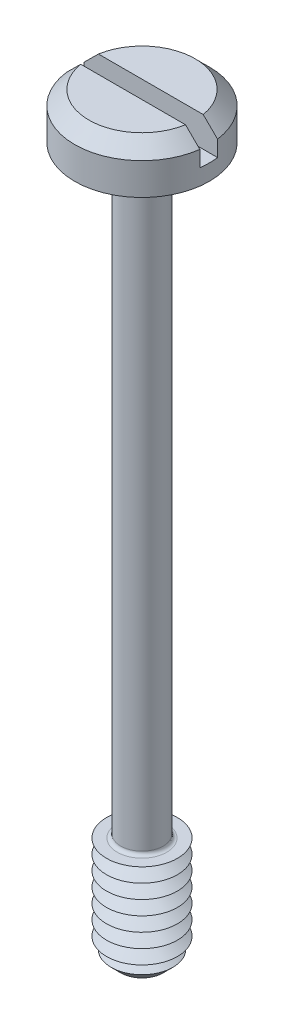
ISO-10303-21;
HEADER;
FILE_DESCRIPTION(('STEP AP214'),'2;1');
FILE_NAME('part.step','',(''),(''),'','','');
FILE_SCHEMA(('AUTOMOTIVE_DESIGN { 1 0 10303 214 1 1 1 1 }'));
ENDSEC;
DATA;
#1=APPLICATION_CONTEXT('core data for automotive mechanical design processes');
#2=APPLICATION_PROTOCOL_DEFINITION('international standard','automotive_design',2000,#1);
#3=PRODUCT_CONTEXT('',#1,'mechanical');
#4=PRODUCT('Part','Part','',(#3));
#5=PRODUCT_RELATED_PRODUCT_CATEGORY('part','',(#4));
#6=PRODUCT_DEFINITION_FORMATION('','',#4);
#7=PRODUCT_DEFINITION_CONTEXT('part definition',#1,'design');
#8=PRODUCT_DEFINITION('design','',#6,#7);
#9=PRODUCT_DEFINITION_SHAPE('','',#8);
#10=(LENGTH_UNIT() NAMED_UNIT(*) SI_UNIT(.MILLI.,.METRE.));
#11=(NAMED_UNIT(*) PLANE_ANGLE_UNIT() SI_UNIT($,.RADIAN.));
#12=(NAMED_UNIT(*) SI_UNIT($,.STERADIAN.) SOLID_ANGLE_UNIT());
#13=UNCERTAINTY_MEASURE_WITH_UNIT(LENGTH_MEASURE(1.E-05),#10,'distance_accuracy_value','');
#14=(GEOMETRIC_REPRESENTATION_CONTEXT(3) GLOBAL_UNCERTAINTY_ASSIGNED_CONTEXT((#13)) GLOBAL_UNIT_ASSIGNED_CONTEXT((#10,
#11,#12)) REPRESENTATION_CONTEXT('',''));
#15=CARTESIAN_POINT('',(0.,0.,0.));
#16=DIRECTION('',(0.,0.,1.));
#17=DIRECTION('',(1.,0.,0.));
#18=AXIS2_PLACEMENT_3D('',#15,#16,#17);
#19=CARTESIAN_POINT('',(0.,1.3,0.));
#20=DIRECTION('',(0.,1.,0.));
#21=DIRECTION('',(0.,0.,1.));
#22=AXIS2_PLACEMENT_3D('',#19,#20,#21);
#23=PLANE('',#22);
#24=DIRECTION('',(-1.,0.,0.));
#25=VECTOR('',#24,1.);
#26=CARTESIAN_POINT('',(1.9,1.3,-0.25));
#27=LINE('',#26,#25);
#28=CARTESIAN_POINT('',(1.4790199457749,1.3,-0.25));
#29=VERTEX_POINT('',#28);
#30=CARTESIAN_POINT('',(-1.4790199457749,1.3,-0.25));
#31=VERTEX_POINT('',#30);
#32=EDGE_CURVE('E110',#29,#31,#27,.T.);
#33=ORIENTED_EDGE('',*,*,#32,.F.);
#34=CARTESIAN_POINT('',(0.,1.3,0.));
#35=DIRECTION('',(0.,1.,0.));
#36=DIRECTION('',(0.,0.,1.));
#37=AXIS2_PLACEMENT_3D('',#34,#35,#36);
#38=CIRCLE('',#37,1.5);
#39=EDGE_CURVE('E113',#29,#31,#38,.T.);
#40=ORIENTED_EDGE('',*,*,#39,.T.);
#41=EDGE_LOOP('',(#33,#40));
#42=FACE_BOUND('',#41,.T.);
#43=ADVANCED_FACE('F39',(#42),#23,.T.);
#44=CARTESIAN_POINT('',(0.,1.3,0.));
#45=DIRECTION('',(0.,-1.,0.));
#46=DIRECTION('',(0.,0.,-1.));
#47=AXIS2_PLACEMENT_3D('',#44,#45,#46);
#48=CONICAL_SURFACE('',#47,1.5,0.785398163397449);
#49=CARTESIAN_POINT('',(4.18533688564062,-1.39279678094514,-0.25));
#50=CARTESIAN_POINT('',(4.0422903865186,-1.25000682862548,-0.25));
#51=CARTESIAN_POINT('',(3.89923277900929,-1.10722799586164,-0.25));
#52=CARTESIAN_POINT('',(3.61307916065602,-0.821704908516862,-0.25));
#53=CARTESIAN_POINT('',(3.46998314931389,-0.678960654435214,-0.25));
#54=CARTESIAN_POINT('',(3.18369629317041,-0.393478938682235,-0.25));
#55=CARTESIAN_POINT('',(3.04050543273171,-0.250741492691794,-0.25));
#56=CARTESIAN_POINT('',(2.75404923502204,0.0346548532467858,-0.25));
#57=CARTESIAN_POINT('',(2.61078389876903,0.177313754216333,-0.25));
#58=CARTESIAN_POINT('',(2.3205519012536,0.466067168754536,-0.25));
#59=CARTESIAN_POINT('',(2.17358212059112,0.612158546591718,-0.25));
#60=CARTESIAN_POINT('',(1.87941274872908,0.904121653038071,-0.25));
#61=CARTESIAN_POINT('',(1.73221314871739,1.04999337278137,-0.25));
#62=CARTESIAN_POINT('',(1.51107316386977,1.26842721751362,-0.25));
#63=CARTESIAN_POINT('',(1.43731034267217,1.34116907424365,-0.25));
#64=CARTESIAN_POINT('',(1.28959621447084,1.48646381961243,-0.25));
#65=CARTESIAN_POINT('',(1.21564490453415,1.55901670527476,-0.25));
#66=CARTESIAN_POINT('',(1.06743357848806,1.70379537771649,-0.25));
#67=CARTESIAN_POINT('',(0.993173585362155,1.77602118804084,-0.25));
#68=CARTESIAN_POINT('',(0.844093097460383,1.91989140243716,-0.25));
#69=CARTESIAN_POINT('',(0.76927262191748,1.99153582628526,-0.25));
#70=CARTESIAN_POINT('',(0.673453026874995,2.0816726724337,-0.25));
#71=CARTESIAN_POINT('',(0.653038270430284,2.10078477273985,-0.25));
#72=CARTESIAN_POINT('',(0.612082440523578,2.13887320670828,-0.25));
#73=CARTESIAN_POINT('',(0.591541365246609,2.1578495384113,-0.25));
#74=CARTESIAN_POINT('',(0.529771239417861,2.21444296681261,-0.25));
#75=CARTESIAN_POINT('',(0.488307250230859,2.25180787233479,-0.25));
#76=CARTESIAN_POINT('',(0.41966366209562,2.31168392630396,-0.25));
#77=CARTESIAN_POINT('',(0.39284043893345,2.3346028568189,-0.25));
#78=CARTESIAN_POINT('',(0.338329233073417,2.37961554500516,-0.25));
#79=CARTESIAN_POINT('',(0.310638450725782,2.40170598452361,-0.25));
#80=CARTESIAN_POINT('',(0.267983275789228,2.43362951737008,-0.25));
#81=CARTESIAN_POINT('',(0.2535095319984,2.4441138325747,-0.25));
#82=CARTESIAN_POINT('',(0.224109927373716,2.46442369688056,-0.25));
#83=CARTESIAN_POINT('',(0.209184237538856,2.47424949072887,-0.25));
#84=CARTESIAN_POINT('',(0.178776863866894,2.49288890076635,-0.25));
#85=CARTESIAN_POINT('',(0.16329738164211,2.50170604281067,-0.25));
#86=CARTESIAN_POINT('',(0.131578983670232,2.51781823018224,-0.25));
#87=CARTESIAN_POINT('',(0.115341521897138,2.52511605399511,-0.25));
#88=CARTESIAN_POINT('',(0.0816993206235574,2.53745946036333,-0.25));
#89=CARTESIAN_POINT('',(0.0642805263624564,2.54246888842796,-0.25));
#90=CARTESIAN_POINT('',(0.028863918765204,2.54892929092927,-0.25));
#91=CARTESIAN_POINT('',(0.0108708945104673,2.55040442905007,-0.25));
#92=CARTESIAN_POINT('',(-0.0250443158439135,2.54939473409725,-0.25));
#93=CARTESIAN_POINT('',(-0.0429661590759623,2.54689872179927,-0.25));
#94=CARTESIAN_POINT('',(-0.0781147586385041,2.5386496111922,-0.25));
#95=CARTESIAN_POINT('',(-0.0953356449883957,2.53287340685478,-0.25));
#96=CARTESIAN_POINT('',(-0.13219925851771,2.51779776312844,-0.25));
#97=CARTESIAN_POINT('',(-0.151639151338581,2.50802516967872,-0.25));
#98=CARTESIAN_POINT('',(-0.189519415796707,2.48667393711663,-0.25));
#99=CARTESIAN_POINT('',(-0.207957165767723,2.47509084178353,-0.25));
#100=CARTESIAN_POINT('',(-0.244227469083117,2.45076455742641,-0.25));
#101=CARTESIAN_POINT('',(-0.262054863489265,2.43801379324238,-0.25));
#102=CARTESIAN_POINT('',(-0.297164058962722,2.41183569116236,-0.25));
#103=CARTESIAN_POINT('',(-0.314446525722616,2.39840923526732,-0.25));
#104=CARTESIAN_POINT('',(-0.371053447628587,2.35323015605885,-0.25));
#105=CARTESIAN_POINT('',(-0.409598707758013,2.32050831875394,-0.25));
#106=CARTESIAN_POINT('',(-0.485753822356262,2.25398879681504,-0.25));
#107=CARTESIAN_POINT('',(-0.52336327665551,2.2201906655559,-0.25));
#108=CARTESIAN_POINT('',(-0.598084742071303,2.15194710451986,-0.25));
#109=CARTESIAN_POINT('',(-0.635196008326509,2.11750085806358,-0.25));
#110=CARTESIAN_POINT('',(-0.709072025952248,2.04825489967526,-0.25));
#111=CARTESIAN_POINT('',(-0.74583684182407,2.01345525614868,-0.25));
#112=CARTESIAN_POINT('',(-0.855349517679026,1.90914588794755,-0.25));
#113=CARTESIAN_POINT('',(-0.927775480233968,1.83929849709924,-0.25));
#114=CARTESIAN_POINT('',(-1.07215273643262,1.69921833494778,-0.25));
#115=CARTESIAN_POINT('',(-1.14410432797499,1.62898586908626,-0.25));
#116=CARTESIAN_POINT('',(-1.33992197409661,1.43719038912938,-0.25));
#117=CARTESIAN_POINT('',(-1.46354933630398,1.31538371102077,-0.25));
#118=CARTESIAN_POINT('',(-1.71048263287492,1.07144356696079,-0.25));
#119=CARTESIAN_POINT('',(-1.83378856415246,0.949310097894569,-0.25));
#120=CARTESIAN_POINT('',(-2.20352581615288,0.582566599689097,-0.25));
#121=CARTESIAN_POINT('',(-2.44969583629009,0.337693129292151,-0.25));
#122=CARTESIAN_POINT('',(-2.94423335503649,-0.154747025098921,-0.25));
#123=CARTESIAN_POINT('',(-3.19259832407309,-0.402316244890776,-0.25));
#124=CARTESIAN_POINT('',(-3.68909403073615,-0.897516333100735,-0.25));
#125=CARTESIAN_POINT('',(-3.93722481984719,-1.14514714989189,-0.25));
#126=CARTESIAN_POINT('',(-4.18533688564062,-1.39279678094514,-0.25));
#127=B_SPLINE_CURVE_WITH_KNOTS('',3,(#49,#50,#51,#52,#53,#54,#55,#56,#57,#58,#59,#60,#61,#62,
#63,#64,#65,#66,#67,#68,#69,#70,#71,#72,#73,#74,#75,#76,#77,#78,#79,#80,#81,#82,#83,#84,#85,#86,
#87,#88,#89,#90,#91,#92,#93,#94,#95,#96,#97,#98,#99,#100,#101,#102,#103,#104,#105,#106,#107,
#108,#109,#110,#111,#112,#113,#114,#115,#116,#117,#118,#119,#120,#121,#122,#123,#124,#125,#126),
.UNSPECIFIED.,.F.,.F.,(4,2,2,2,2,2,2,2,2,2,2,2,2,2,2,2,2,2,2,2,2,2,2,2,2,2,2,2,2,2,2,2,2,2,2,2,
2,2,4),(0.,0.606350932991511,1.21271015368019,1.81925643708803,2.42579463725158,
3.04747398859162,3.66917779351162,3.97996857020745,4.29076421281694,4.60153711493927,
4.91229940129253,4.99619332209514,5.08008845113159,5.24751495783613,5.35335108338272,
5.45957361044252,5.5131778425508,5.56676204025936,5.62015280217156,5.67344504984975,
5.72755238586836,5.78128872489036,5.83517660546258,5.88944887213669,5.95455572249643,
6.01982542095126,6.08555345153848,6.15119780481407,6.30282427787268,6.45451451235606,
6.60641073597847,6.75827809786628,7.06012987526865,7.3617694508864,7.88242595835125,
8.40308744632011,9.44475070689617,10.4967873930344,11.5484571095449),.UNSPECIFIED.);
#128=CARTESIAN_POINT('',(1.88348082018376,0.899999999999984,-0.25));
#129=VERTEX_POINT('',#128);
#130=EDGE_CURVE('E252',#129,#29,#127,.T.);
#131=ORIENTED_EDGE('',*,*,#130,.F.);
#132=CARTESIAN_POINT('',(0.,0.899999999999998,0.));
#133=DIRECTION('',(0.,1.,0.));
#134=DIRECTION('',(0.,0.,1.));
#135=AXIS2_PLACEMENT_3D('',#132,#133,#134);
#136=CIRCLE('',#135,1.9);
#137=CARTESIAN_POINT('',(-1.88348082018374,0.899999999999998,-0.25));
#138=VERTEX_POINT('',#137);
#139=EDGE_CURVE('E128',#138,#129,#136,.F.);
#140=ORIENTED_EDGE('',*,*,#139,.F.);
#141=EDGE_CURVE('E102',#31,#138,#127,.T.);
#142=ORIENTED_EDGE('',*,*,#141,.F.);
#143=ORIENTED_EDGE('',*,*,#39,.F.);
#144=EDGE_LOOP('',(#131,#140,#142,#143));
#145=FACE_BOUND('',#144,.T.);
#146=ADVANCED_FACE('F214',(#145),#48,.T.);
#147=CARTESIAN_POINT('',(0.,-20.,0.));
#148=DIRECTION('',(0.,1.,0.));
#149=DIRECTION('',(0.,0.,1.));
#150=AXIS2_PLACEMENT_3D('',#147,#148,#149);
#151=CYLINDRICAL_SURFACE('',#150,0.6);
#152=CARTESIAN_POINT('',(0.,-16.9,0.));
#153=DIRECTION('',(0.,-1.,0.));
#154=DIRECTION('',(0.,0.,-1.));
#155=AXIS2_PLACEMENT_3D('',#152,#153,#154);
#156=CIRCLE('',#155,0.6);
#157=CARTESIAN_POINT('',(0.,-16.9,-0.6));
#158=VERTEX_POINT('',#157);
#159=EDGE_CURVE('E123',#158,#158,#156,.F.);
#160=ORIENTED_EDGE('',*,*,#159,.T.);
#161=EDGE_LOOP('',(#160));
#162=FACE_BOUND('',#161,.T.);
#163=CARTESIAN_POINT('',(0.,-0.0999999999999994,0.));
#164=DIRECTION('',(0.,1.,0.));
#165=DIRECTION('',(0.,0.,1.));
#166=AXIS2_PLACEMENT_3D('',#163,#164,#165);
#167=CIRCLE('',#166,0.6);
#168=CARTESIAN_POINT('',(0.,-0.0999999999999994,0.6));
#169=VERTEX_POINT('',#168);
#170=EDGE_CURVE('E350',#169,#169,#167,.F.);
#171=ORIENTED_EDGE('',*,*,#170,.T.);
#172=EDGE_LOOP('',(#171));
#173=FACE_BOUND('',#172,.T.);
#174=ADVANCED_FACE('F210',(#162,#173),#151,.T.);
#175=CARTESIAN_POINT('',(0.,1.3,0.));
#176=DIRECTION('',(0.,-1.,0.));
#177=DIRECTION('',(0.,0.,-1.));
#178=AXIS2_PLACEMENT_3D('',#175,#176,#177);
#179=CYLINDRICAL_SURFACE('',#178,1.9);
#180=ORIENTED_EDGE('',*,*,#139,.T.);
#181=DIRECTION('',(0.,-1.,0.));
#182=VECTOR('',#181,1.);
#183=CARTESIAN_POINT('',(1.88348082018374,1.3,-0.25));
#184=LINE('',#183,#182);
#185=CARTESIAN_POINT('',(1.88348082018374,0.45,-0.25));
#186=VERTEX_POINT('',#185);
#187=EDGE_CURVE('E64',#129,#186,#184,.T.);
#188=ORIENTED_EDGE('',*,*,#187,.T.);
#189=CARTESIAN_POINT('',(0.,0.45,0.));
#190=DIRECTION('',(0.,1.,0.));
#191=DIRECTION('',(0.,0.,1.));
#192=AXIS2_PLACEMENT_3D('',#189,#190,#191);
#193=CIRCLE('',#192,1.9);
#194=CARTESIAN_POINT('',(1.88348082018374,0.45,0.25));
#195=VERTEX_POINT('',#194);
#196=EDGE_CURVE('E11',#195,#186,#193,.T.);
#197=ORIENTED_EDGE('',*,*,#196,.F.);
#198=DIRECTION('',(0.,-1.,0.));
#199=VECTOR('',#198,1.);
#200=CARTESIAN_POINT('',(1.88348082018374,1.3,0.25));
#201=LINE('',#200,#199);
#202=CARTESIAN_POINT('',(1.88348082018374,0.899999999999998,0.25));
#203=VERTEX_POINT('',#202);
#204=EDGE_CURVE('E268',#195,#203,#201,.F.);
#205=ORIENTED_EDGE('',*,*,#204,.T.);
#206=CARTESIAN_POINT('',(-1.88348082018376,0.899999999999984,0.25));
#207=VERTEX_POINT('',#206);
#208=EDGE_CURVE('E120',#203,#207,#136,.F.);
#209=ORIENTED_EDGE('',*,*,#208,.T.);
#210=DIRECTION('',(0.,-1.,0.));
#211=VECTOR('',#210,1.);
#212=CARTESIAN_POINT('',(-1.88348082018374,1.3,0.25));
#213=LINE('',#212,#211);
#214=CARTESIAN_POINT('',(-1.88348082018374,0.45,0.25));
#215=VERTEX_POINT('',#214);
#216=EDGE_CURVE('E96',#207,#215,#213,.T.);
#217=ORIENTED_EDGE('',*,*,#216,.T.);
#218=CARTESIAN_POINT('',(-1.88348082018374,0.45,-0.25));
#219=VERTEX_POINT('',#218);
#220=EDGE_CURVE('E44',#219,#215,#193,.T.);
#221=ORIENTED_EDGE('',*,*,#220,.F.);
#222=DIRECTION('',(0.,-1.,0.));
#223=VECTOR('',#222,1.);
#224=CARTESIAN_POINT('',(-1.88348082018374,1.3,-0.25));
#225=LINE('',#224,#223);
#226=EDGE_CURVE('E272',#219,#138,#225,.F.);
#227=ORIENTED_EDGE('',*,*,#226,.T.);
#228=EDGE_LOOP('',(#180,#188,#197,#205,#209,#217,#221,#227));
#229=FACE_BOUND('',#228,.T.);
#230=CARTESIAN_POINT('',(0.,0.,0.));
#231=DIRECTION('',(0.,1.,0.));
#232=DIRECTION('',(0.,0.,1.));
#233=AXIS2_PLACEMENT_3D('',#230,#231,#232);
#234=CIRCLE('',#233,1.9);
#235=CARTESIAN_POINT('',(0.,0.,1.9));
#236=VERTEX_POINT('',#235);
#237=EDGE_CURVE('E335',#236,#236,#234,.T.);
#238=ORIENTED_EDGE('',*,*,#237,.T.);
#239=EDGE_LOOP('',(#238));
#240=FACE_BOUND('',#239,.T.);
#241=ADVANCED_FACE('F213',(#229,#240),#179,.T.);
#242=DIRECTION('',(1.,0.,0.));
#243=VECTOR('',#242,1.);
#244=CARTESIAN_POINT('',(1.9,1.3,0.25));
#245=LINE('',#244,#243);
#246=CARTESIAN_POINT('',(-1.4790199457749,1.3,0.25));
#247=VERTEX_POINT('',#246);
#248=CARTESIAN_POINT('',(1.4790199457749,1.3,0.25));
#249=VERTEX_POINT('',#248);
#250=EDGE_CURVE('E56',#247,#249,#245,.T.);
#251=ORIENTED_EDGE('',*,*,#250,.F.);
#252=EDGE_CURVE('E108',#247,#249,#38,.T.);
#253=ORIENTED_EDGE('',*,*,#252,.T.);
#254=EDGE_LOOP('',(#251,#253));
#255=FACE_BOUND('',#254,.T.);
#256=ADVANCED_FACE('F107',(#255),#23,.T.);
#257=CARTESIAN_POINT('',(0.,0.,0.));
#258=DIRECTION('',(0.,1.,0.));
#259=DIRECTION('',(0.,0.,1.));
#260=AXIS2_PLACEMENT_3D('',#257,#258,#259);
#261=PLANE('',#260);
#262=CARTESIAN_POINT('',(0.,0.,0.));
#263=DIRECTION('',(0.,1.,0.));
#264=DIRECTION('',(0.,0.,1.));
#265=AXIS2_PLACEMENT_3D('',#262,#263,#264);
#266=CIRCLE('',#265,0.7);
#267=CARTESIAN_POINT('',(0.,0.,0.7));
#268=VERTEX_POINT('',#267);
#269=EDGE_CURVE('E114',#268,#268,#266,.T.);
#270=ORIENTED_EDGE('',*,*,#269,.T.);
#271=EDGE_LOOP('',(#270));
#272=FACE_BOUND('',#271,.T.);
#273=ORIENTED_EDGE('',*,*,#237,.F.);
#274=EDGE_LOOP('',(#273));
#275=FACE_BOUND('',#274,.T.);
#276=ADVANCED_FACE('F204',(#272,#275),#261,.F.);
#277=CARTESIAN_POINT('',(0.,-17.,0.));
#278=DIRECTION('',(0.,-1.,0.));
#279=DIRECTION('',(0.,0.,-1.));
#280=AXIS2_PLACEMENT_3D('',#277,#278,#279);
#281=PLANE('',#280);
#282=CARTESIAN_POINT('',(0.,-17.,0.));
#283=DIRECTION('',(0.,-1.,0.));
#284=DIRECTION('',(0.,0.,-1.));
#285=AXIS2_PLACEMENT_3D('',#282,#283,#284);
#286=CIRCLE('',#285,0.7);
#287=CARTESIAN_POINT('',(0.,-17.,-0.7));
#288=VERTEX_POINT('',#287);
#289=EDGE_CURVE('E343',#288,#288,#286,.T.);
#290=ORIENTED_EDGE('',*,*,#289,.T.);
#291=EDGE_LOOP('',(#290));
#292=FACE_BOUND('',#291,.T.);
#293=CARTESIAN_POINT('',(0.,-17.,0.));
#294=DIRECTION('',(0.,1.,0.));
#295=DIRECTION('',(0.,0.,1.));
#296=AXIS2_PLACEMENT_3D('',#293,#294,#295);
#297=CIRCLE('',#296,1.);
#298=CARTESIAN_POINT('',(0.,-17.,1.));
#299=VERTEX_POINT('',#298);
#300=EDGE_CURVE('E331',#299,#299,#297,.T.);
#301=ORIENTED_EDGE('',*,*,#300,.T.);
#302=EDGE_LOOP('',(#301));
#303=FACE_BOUND('',#302,.T.);
#304=ADVANCED_FACE('F200',(#292,#303),#281,.F.);
#305=CARTESIAN_POINT('',(0.,-17.2,0.));
#306=DIRECTION('',(0.,1.,0.));
#307=DIRECTION('',(0.,0.,1.));
#308=AXIS2_PLACEMENT_3D('',#305,#306,#307);
#309=CONICAL_SURFACE('',#308,0.653589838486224,1.0471975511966);
#310=ORIENTED_EDGE('',*,*,#300,.F.);
#311=EDGE_LOOP('',(#310));
#312=FACE_BOUND('',#311,.T.);
#313=CARTESIAN_POINT('',(0.,-17.2,0.));
#314=DIRECTION('',(0.,1.,0.));
#315=DIRECTION('',(0.,0.,1.));
#316=AXIS2_PLACEMENT_3D('',#313,#314,#315);
#317=CIRCLE('',#316,0.653589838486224);
#318=CARTESIAN_POINT('',(0.,-17.2,0.653589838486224));
#319=VERTEX_POINT('',#318);
#320=EDGE_CURVE('E328',#319,#319,#317,.T.);
#321=ORIENTED_EDGE('',*,*,#320,.T.);
#322=EDGE_LOOP('',(#321));
#323=FACE_BOUND('',#322,.T.);
#324=ADVANCED_FACE('F196',(#312,#323),#309,.T.);
#325=CARTESIAN_POINT('',(0.,-17.4,0.));
#326=DIRECTION('',(0.,-1.,0.));
#327=DIRECTION('',(0.,0.,-1.));
#328=AXIS2_PLACEMENT_3D('',#325,#326,#327);
#329=CONICAL_SURFACE('',#328,1.,1.04719755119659);
#330=ORIENTED_EDGE('',*,*,#320,.F.);
#331=EDGE_LOOP('',(#330));
#332=FACE_BOUND('',#331,.T.);
#333=CARTESIAN_POINT('',(0.,-17.4,0.));
#334=DIRECTION('',(0.,1.,0.));
#335=DIRECTION('',(0.,0.,1.));
#336=AXIS2_PLACEMENT_3D('',#333,#334,#335);
#337=CIRCLE('',#336,1.);
#338=CARTESIAN_POINT('',(0.,-17.4,1.));
#339=VERTEX_POINT('',#338);
#340=EDGE_CURVE('E324',#339,#339,#337,.T.);
#341=ORIENTED_EDGE('',*,*,#340,.T.);
#342=EDGE_LOOP('',(#341));
#343=FACE_BOUND('',#342,.T.);
#344=ADVANCED_FACE('F192',(#332,#343),#329,.T.);
#345=CARTESIAN_POINT('',(0.,-17.6,0.));
#346=DIRECTION('',(0.,1.,0.));
#347=DIRECTION('',(0.,0.,1.));
#348=AXIS2_PLACEMENT_3D('',#345,#346,#347);
#349=CONICAL_SURFACE('',#348,0.653589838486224,1.0471975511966);
#350=ORIENTED_EDGE('',*,*,#340,.F.);
#351=EDGE_LOOP('',(#350));
#352=FACE_BOUND('',#351,.T.);
#353=CARTESIAN_POINT('',(0.,-17.6,0.));
#354=DIRECTION('',(0.,1.,0.));
#355=DIRECTION('',(0.,0.,1.));
#356=AXIS2_PLACEMENT_3D('',#353,#354,#355);
#357=CIRCLE('',#356,0.653589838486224);
#358=CARTESIAN_POINT('',(0.,-17.6,0.653589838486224));
#359=VERTEX_POINT('',#358);
#360=EDGE_CURVE('E321',#359,#359,#357,.T.);
#361=ORIENTED_EDGE('',*,*,#360,.T.);
#362=EDGE_LOOP('',(#361));
#363=FACE_BOUND('',#362,.T.);
#364=ADVANCED_FACE('F188',(#352,#363),#349,.T.);
#365=CARTESIAN_POINT('',(0.,-17.8,0.));
#366=DIRECTION('',(0.,-1.,0.));
#367=DIRECTION('',(0.,0.,-1.));
#368=AXIS2_PLACEMENT_3D('',#365,#366,#367);
#369=CONICAL_SURFACE('',#368,1.,1.04719755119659);
#370=ORIENTED_EDGE('',*,*,#360,.F.);
#371=EDGE_LOOP('',(#370));
#372=FACE_BOUND('',#371,.T.);
#373=CARTESIAN_POINT('',(0.,-17.8,0.));
#374=DIRECTION('',(0.,1.,0.));
#375=DIRECTION('',(0.,0.,1.));
#376=AXIS2_PLACEMENT_3D('',#373,#374,#375);
#377=CIRCLE('',#376,1.);
#378=CARTESIAN_POINT('',(0.,-17.8,1.));
#379=VERTEX_POINT('',#378);
#380=EDGE_CURVE('E318',#379,#379,#377,.T.);
#381=ORIENTED_EDGE('',*,*,#380,.T.);
#382=EDGE_LOOP('',(#381));
#383=FACE_BOUND('',#382,.T.);
#384=ADVANCED_FACE('F184',(#372,#383),#369,.T.);
#385=CARTESIAN_POINT('',(0.,-18.,0.));
#386=DIRECTION('',(0.,1.,0.));
#387=DIRECTION('',(0.,0.,1.));
#388=AXIS2_PLACEMENT_3D('',#385,#386,#387);
#389=CONICAL_SURFACE('',#388,0.653589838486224,1.0471975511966);
#390=ORIENTED_EDGE('',*,*,#380,.F.);
#391=EDGE_LOOP('',(#390));
#392=FACE_BOUND('',#391,.T.);
#393=CARTESIAN_POINT('',(0.,-18.,0.));
#394=DIRECTION('',(0.,1.,0.));
#395=DIRECTION('',(0.,0.,1.));
#396=AXIS2_PLACEMENT_3D('',#393,#394,#395);
#397=CIRCLE('',#396,0.653589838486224);
#398=CARTESIAN_POINT('',(0.,-18.,0.653589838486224));
#399=VERTEX_POINT('',#398);
#400=EDGE_CURVE('E314',#399,#399,#397,.T.);
#401=ORIENTED_EDGE('',*,*,#400,.T.);
#402=EDGE_LOOP('',(#401));
#403=FACE_BOUND('',#402,.T.);
#404=ADVANCED_FACE('F180',(#392,#403),#389,.T.);
#405=CARTESIAN_POINT('',(0.,-18.2,0.));
#406=DIRECTION('',(0.,-1.,0.));
#407=DIRECTION('',(0.,0.,-1.));
#408=AXIS2_PLACEMENT_3D('',#405,#406,#407);
#409=CONICAL_SURFACE('',#408,1.,1.04719755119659);
#410=ORIENTED_EDGE('',*,*,#400,.F.);
#411=EDGE_LOOP('',(#410));
#412=FACE_BOUND('',#411,.T.);
#413=CARTESIAN_POINT('',(0.,-18.2,0.));
#414=DIRECTION('',(0.,1.,0.));
#415=DIRECTION('',(0.,0.,1.));
#416=AXIS2_PLACEMENT_3D('',#413,#414,#415);
#417=CIRCLE('',#416,1.);
#418=CARTESIAN_POINT('',(0.,-18.2,1.));
#419=VERTEX_POINT('',#418);
#420=EDGE_CURVE('E310',#419,#419,#417,.T.);
#421=ORIENTED_EDGE('',*,*,#420,.T.);
#422=EDGE_LOOP('',(#421));
#423=FACE_BOUND('',#422,.T.);
#424=ADVANCED_FACE('F176',(#412,#423),#409,.T.);
#425=CARTESIAN_POINT('',(0.,-18.4,0.));
#426=DIRECTION('',(0.,1.,0.));
#427=DIRECTION('',(0.,0.,1.));
#428=AXIS2_PLACEMENT_3D('',#425,#426,#427);
#429=CONICAL_SURFACE('',#428,0.653589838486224,1.0471975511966);
#430=ORIENTED_EDGE('',*,*,#420,.F.);
#431=EDGE_LOOP('',(#430));
#432=FACE_BOUND('',#431,.T.);
#433=CARTESIAN_POINT('',(0.,-18.4,0.));
#434=DIRECTION('',(0.,1.,0.));
#435=DIRECTION('',(0.,0.,1.));
#436=AXIS2_PLACEMENT_3D('',#433,#434,#435);
#437=CIRCLE('',#436,0.653589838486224);
#438=CARTESIAN_POINT('',(0.,-18.4,0.653589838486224));
#439=VERTEX_POINT('',#438);
#440=EDGE_CURVE('E307',#439,#439,#437,.T.);
#441=ORIENTED_EDGE('',*,*,#440,.T.);
#442=EDGE_LOOP('',(#441));
#443=FACE_BOUND('',#442,.T.);
#444=ADVANCED_FACE('F172',(#432,#443),#429,.T.);
#445=CARTESIAN_POINT('',(0.,-18.6,0.));
#446=DIRECTION('',(0.,-1.,0.));
#447=DIRECTION('',(0.,0.,-1.));
#448=AXIS2_PLACEMENT_3D('',#445,#446,#447);
#449=CONICAL_SURFACE('',#448,1.,1.04719755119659);
#450=ORIENTED_EDGE('',*,*,#440,.F.);
#451=EDGE_LOOP('',(#450));
#452=FACE_BOUND('',#451,.T.);
#453=CARTESIAN_POINT('',(0.,-18.6,0.));
#454=DIRECTION('',(0.,1.,0.));
#455=DIRECTION('',(0.,0.,1.));
#456=AXIS2_PLACEMENT_3D('',#453,#454,#455);
#457=CIRCLE('',#456,1.);
#458=CARTESIAN_POINT('',(0.,-18.6,1.));
#459=VERTEX_POINT('',#458);
#460=EDGE_CURVE('E303',#459,#459,#457,.T.);
#461=ORIENTED_EDGE('',*,*,#460,.T.);
#462=EDGE_LOOP('',(#461));
#463=FACE_BOUND('',#462,.T.);
#464=ADVANCED_FACE('F168',(#452,#463),#449,.T.);
#465=CARTESIAN_POINT('',(0.,-18.8,0.));
#466=DIRECTION('',(0.,1.,0.));
#467=DIRECTION('',(0.,0.,1.));
#468=AXIS2_PLACEMENT_3D('',#465,#466,#467);
#469=CONICAL_SURFACE('',#468,0.653589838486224,1.0471975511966);
#470=ORIENTED_EDGE('',*,*,#460,.F.);
#471=EDGE_LOOP('',(#470));
#472=FACE_BOUND('',#471,.T.);
#473=CARTESIAN_POINT('',(0.,-18.8,0.));
#474=DIRECTION('',(0.,1.,0.));
#475=DIRECTION('',(0.,0.,1.));
#476=AXIS2_PLACEMENT_3D('',#473,#474,#475);
#477=CIRCLE('',#476,0.653589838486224);
#478=CARTESIAN_POINT('',(0.,-18.8,0.653589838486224));
#479=VERTEX_POINT('',#478);
#480=EDGE_CURVE('E299',#479,#479,#477,.T.);
#481=ORIENTED_EDGE('',*,*,#480,.T.);
#482=EDGE_LOOP('',(#481));
#483=FACE_BOUND('',#482,.T.);
#484=ADVANCED_FACE('F164',(#472,#483),#469,.T.);
#485=CARTESIAN_POINT('',(0.,-19.,0.));
#486=DIRECTION('',(0.,-1.,0.));
#487=DIRECTION('',(0.,0.,-1.));
#488=AXIS2_PLACEMENT_3D('',#485,#486,#487);
#489=CONICAL_SURFACE('',#488,1.,1.04719755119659);
#490=ORIENTED_EDGE('',*,*,#480,.F.);
#491=EDGE_LOOP('',(#490));
#492=FACE_BOUND('',#491,.T.);
#493=CARTESIAN_POINT('',(0.,-19.,0.));
#494=DIRECTION('',(0.,1.,0.));
#495=DIRECTION('',(0.,0.,1.));
#496=AXIS2_PLACEMENT_3D('',#493,#494,#495);
#497=CIRCLE('',#496,1.);
#498=CARTESIAN_POINT('',(0.,-19.,1.));
#499=VERTEX_POINT('',#498);
#500=EDGE_CURVE('E295',#499,#499,#497,.T.);
#501=ORIENTED_EDGE('',*,*,#500,.T.);
#502=EDGE_LOOP('',(#501));
#503=FACE_BOUND('',#502,.T.);
#504=ADVANCED_FACE('F160',(#492,#503),#489,.T.);
#505=CARTESIAN_POINT('',(0.,-19.2,0.));
#506=DIRECTION('',(0.,1.,0.));
#507=DIRECTION('',(0.,0.,1.));
#508=AXIS2_PLACEMENT_3D('',#505,#506,#507);
#509=CONICAL_SURFACE('',#508,0.653589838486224,1.0471975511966);
#510=ORIENTED_EDGE('',*,*,#500,.F.);
#511=EDGE_LOOP('',(#510));
#512=FACE_BOUND('',#511,.T.);
#513=CARTESIAN_POINT('',(0.,-19.2,0.));
#514=DIRECTION('',(0.,1.,0.));
#515=DIRECTION('',(0.,0.,1.));
#516=AXIS2_PLACEMENT_3D('',#513,#514,#515);
#517=CIRCLE('',#516,0.653589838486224);
#518=CARTESIAN_POINT('',(0.,-19.2,0.653589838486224));
#519=VERTEX_POINT('',#518);
#520=EDGE_CURVE('E291',#519,#519,#517,.T.);
#521=ORIENTED_EDGE('',*,*,#520,.T.);
#522=EDGE_LOOP('',(#521));
#523=FACE_BOUND('',#522,.T.);
#524=ADVANCED_FACE('F156',(#512,#523),#509,.T.);
#525=CARTESIAN_POINT('',(0.,-19.4,0.));
#526=DIRECTION('',(0.,-1.,0.));
#527=DIRECTION('',(0.,0.,-1.));
#528=AXIS2_PLACEMENT_3D('',#525,#526,#527);
#529=CONICAL_SURFACE('',#528,1.,1.04719755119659);
#530=ORIENTED_EDGE('',*,*,#520,.F.);
#531=EDGE_LOOP('',(#530));
#532=FACE_BOUND('',#531,.T.);
#533=CARTESIAN_POINT('',(0.,-19.4,0.));
#534=DIRECTION('',(0.,1.,0.));
#535=DIRECTION('',(0.,0.,1.));
#536=AXIS2_PLACEMENT_3D('',#533,#534,#535);
#537=CIRCLE('',#536,1.);
#538=CARTESIAN_POINT('',(0.,-19.4,1.));
#539=VERTEX_POINT('',#538);
#540=EDGE_CURVE('E286',#539,#539,#537,.T.);
#541=ORIENTED_EDGE('',*,*,#540,.T.);
#542=EDGE_LOOP('',(#541));
#543=FACE_BOUND('',#542,.T.);
#544=ADVANCED_FACE('F152',(#532,#543),#529,.T.);
#545=CARTESIAN_POINT('',(0.,-19.6,0.));
#546=DIRECTION('',(0.,1.,0.));
#547=DIRECTION('',(0.,0.,1.));
#548=AXIS2_PLACEMENT_3D('',#545,#546,#547);
#549=CONICAL_SURFACE('',#548,0.653589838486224,1.0471975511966);
#550=ORIENTED_EDGE('',*,*,#540,.F.);
#551=EDGE_LOOP('',(#550));
#552=FACE_BOUND('',#551,.T.);
#553=CARTESIAN_POINT('',(0.,-19.6,0.));
#554=DIRECTION('',(0.,1.,0.));
#555=DIRECTION('',(0.,0.,1.));
#556=AXIS2_PLACEMENT_3D('',#553,#554,#555);
#557=CIRCLE('',#556,0.653589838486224);
#558=CARTESIAN_POINT('',(0.,-19.6,0.653589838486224));
#559=VERTEX_POINT('',#558);
#560=EDGE_CURVE('E282',#559,#559,#557,.T.);
#561=ORIENTED_EDGE('',*,*,#560,.T.);
#562=EDGE_LOOP('',(#561));
#563=FACE_BOUND('',#562,.T.);
#564=ADVANCED_FACE('F148',(#552,#563),#549,.T.);
#565=CARTESIAN_POINT('',(0.,-19.8,0.));
#566=DIRECTION('',(0.,-1.,0.));
#567=DIRECTION('',(0.,0.,-1.));
#568=AXIS2_PLACEMENT_3D('',#565,#566,#567);
#569=CONICAL_SURFACE('',#568,1.,1.04719755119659);
#570=CARTESIAN_POINT('',(0.,-19.7267949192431,0.));
#571=DIRECTION('',(0.,-1.,0.));
#572=DIRECTION('',(0.,0.,-1.));
#573=AXIS2_PLACEMENT_3D('',#570,#571,#572);
#574=CIRCLE('',#573,0.873205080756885);
#575=CARTESIAN_POINT('',(0.,-19.7267949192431,-0.873205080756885));
#576=VERTEX_POINT('',#575);
#577=EDGE_CURVE('E290',#576,#576,#574,.F.);
#578=ORIENTED_EDGE('',*,*,#577,.T.);
#579=EDGE_LOOP('',(#578));
#580=FACE_BOUND('',#579,.T.);
#581=ORIENTED_EDGE('',*,*,#560,.F.);
#582=EDGE_LOOP('',(#581));
#583=FACE_BOUND('',#582,.T.);
#584=ADVANCED_FACE('F144',(#580,#583),#569,.T.);
#585=CARTESIAN_POINT('',(0.,-20.,0.));
#586=DIRECTION('',(0.,-1.,0.));
#587=DIRECTION('',(0.,0.,-1.));
#588=AXIS2_PLACEMENT_3D('',#585,#586,#587);
#589=PLANE('',#588);
#590=CARTESIAN_POINT('',(0.,-20.,0.));
#591=DIRECTION('',(0.,-1.,0.));
#592=DIRECTION('',(0.,0.,-1.));
#593=AXIS2_PLACEMENT_3D('',#590,#591,#592);
#594=CIRCLE('',#593,0.6);
#595=CARTESIAN_POINT('',(0.,-20.,-0.6));
#596=VERTEX_POINT('',#595);
#597=EDGE_CURVE('E339',#596,#596,#594,.T.);
#598=ORIENTED_EDGE('',*,*,#597,.T.);
#599=EDGE_LOOP('',(#598));
#600=FACE_BOUND('',#599,.T.);
#601=ADVANCED_FACE('F147',(#600),#589,.T.);
#602=CARTESIAN_POINT('',(0.,-20.,0.));
#603=DIRECTION('',(0.,1.,0.));
#604=DIRECTION('',(0.,0.,1.));
#605=AXIS2_PLACEMENT_3D('',#602,#603,#604);
#606=CONICAL_SURFACE('',#605,0.6,0.785398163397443);
#607=ORIENTED_EDGE('',*,*,#577,.F.);
#608=EDGE_LOOP('',(#607));
#609=FACE_BOUND('',#608,.T.);
#610=ORIENTED_EDGE('',*,*,#597,.F.);
#611=EDGE_LOOP('',(#610));
#612=FACE_BOUND('',#611,.T.);
#613=ADVANCED_FACE('F208',(#609,#612),#606,.T.);
#614=CARTESIAN_POINT('',(0.,-16.9,0.));
#615=DIRECTION('',(0.,-1.,0.));
#616=DIRECTION('',(0.,0.,-1.));
#617=AXIS2_PLACEMENT_3D('',#614,#615,#616);
#618=TOROIDAL_SURFACE('',#617,0.7,0.1);
#619=ORIENTED_EDGE('',*,*,#159,.F.);
#620=EDGE_LOOP('',(#619));
#621=FACE_BOUND('',#620,.T.);
#622=ORIENTED_EDGE('',*,*,#289,.F.);
#623=EDGE_LOOP('',(#622));
#624=FACE_BOUND('',#623,.T.);
#625=ADVANCED_FACE('F226',(#621,#624),#618,.F.);
#626=CARTESIAN_POINT('',(0.,-0.0999999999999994,0.));
#627=DIRECTION('',(0.,1.,0.));
#628=DIRECTION('',(0.,0.,1.));
#629=AXIS2_PLACEMENT_3D('',#626,#627,#628);
#630=TOROIDAL_SURFACE('',#629,0.7,0.1);
#631=ORIENTED_EDGE('',*,*,#269,.F.);
#632=EDGE_LOOP('',(#631));
#633=FACE_BOUND('',#632,.T.);
#634=ORIENTED_EDGE('',*,*,#170,.F.);
#635=EDGE_LOOP('',(#634));
#636=FACE_BOUND('',#635,.T.);
#637=ADVANCED_FACE('F229',(#633,#636),#630,.F.);
#638=CARTESIAN_POINT('',(-4.18533688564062,-1.39279678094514,0.25));
#639=CARTESIAN_POINT('',(-4.0422903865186,-1.25000682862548,0.25));
#640=CARTESIAN_POINT('',(-3.89923277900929,-1.10722799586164,0.25));
#641=CARTESIAN_POINT('',(-3.61307916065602,-0.821704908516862,0.25));
#642=CARTESIAN_POINT('',(-3.46998314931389,-0.678960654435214,0.25));
#643=CARTESIAN_POINT('',(-3.18369629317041,-0.393478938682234,0.25));
#644=CARTESIAN_POINT('',(-3.04050543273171,-0.250741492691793,0.25));
#645=CARTESIAN_POINT('',(-2.75404923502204,0.0346548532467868,0.25));
#646=CARTESIAN_POINT('',(-2.61078389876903,0.177313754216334,0.25));
#647=CARTESIAN_POINT('',(-2.3205519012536,0.466067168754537,0.25));
#648=CARTESIAN_POINT('',(-2.17358212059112,0.612158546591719,0.25));
#649=CARTESIAN_POINT('',(-1.87941274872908,0.904121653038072,0.25));
#650=CARTESIAN_POINT('',(-1.73221314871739,1.04999337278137,0.25));
#651=CARTESIAN_POINT('',(-1.51107316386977,1.26842721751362,0.25));
#652=CARTESIAN_POINT('',(-1.43731034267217,1.34116907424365,0.25));
#653=CARTESIAN_POINT('',(-1.28959621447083,1.48646381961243,0.25));
#654=CARTESIAN_POINT('',(-1.21564490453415,1.55901670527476,0.25));
#655=CARTESIAN_POINT('',(-1.06743357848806,1.70379537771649,0.25));
#656=CARTESIAN_POINT('',(-0.993173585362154,1.77602118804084,0.25));
#657=CARTESIAN_POINT('',(-0.844093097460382,1.91989140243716,0.25));
#658=CARTESIAN_POINT('',(-0.76927262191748,1.99153582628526,0.25));
#659=CARTESIAN_POINT('',(-0.673453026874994,2.0816726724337,0.25));
#660=CARTESIAN_POINT('',(-0.653038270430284,2.10078477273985,0.25));
#661=CARTESIAN_POINT('',(-0.612082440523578,2.13887320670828,0.25));
#662=CARTESIAN_POINT('',(-0.591541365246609,2.1578495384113,0.25));
#663=CARTESIAN_POINT('',(-0.52977123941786,2.21444296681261,0.25));
#664=CARTESIAN_POINT('',(-0.488307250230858,2.25180787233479,0.25));
#665=CARTESIAN_POINT('',(-0.419663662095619,2.31168392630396,0.25));
#666=CARTESIAN_POINT('',(-0.39284043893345,2.3346028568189,0.25));
#667=CARTESIAN_POINT('',(-0.338329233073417,2.37961554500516,0.25));
#668=CARTESIAN_POINT('',(-0.310638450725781,2.40170598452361,0.25));
#669=CARTESIAN_POINT('',(-0.267983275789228,2.43362951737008,0.25));
#670=CARTESIAN_POINT('',(-0.253509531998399,2.4441138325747,0.25));
#671=CARTESIAN_POINT('',(-0.224109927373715,2.46442369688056,0.25));
#672=CARTESIAN_POINT('',(-0.209184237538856,2.47424949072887,0.25));
#673=CARTESIAN_POINT('',(-0.178776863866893,2.49288890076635,0.25));
#674=CARTESIAN_POINT('',(-0.16329738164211,2.50170604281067,0.25));
#675=CARTESIAN_POINT('',(-0.131578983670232,2.51781823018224,0.25));
#676=CARTESIAN_POINT('',(-0.115341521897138,2.52511605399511,0.25));
#677=CARTESIAN_POINT('',(-0.081699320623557,2.53745946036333,0.25));
#678=CARTESIAN_POINT('',(-0.0642805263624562,2.54246888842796,0.25));
#679=CARTESIAN_POINT('',(-0.0288639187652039,2.54892929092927,0.25));
#680=CARTESIAN_POINT('',(-0.0108708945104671,2.55040442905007,0.25));
#681=CARTESIAN_POINT('',(0.0250443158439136,2.54939473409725,0.25));
#682=CARTESIAN_POINT('',(0.0429661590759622,2.54689872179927,0.25));
#683=CARTESIAN_POINT('',(0.0781147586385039,2.5386496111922,0.25));
#684=CARTESIAN_POINT('',(0.0953356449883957,2.53287340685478,0.25));
#685=CARTESIAN_POINT('',(0.13219925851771,2.51779776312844,0.25));
#686=CARTESIAN_POINT('',(0.151639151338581,2.50802516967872,0.25));
#687=CARTESIAN_POINT('',(0.189519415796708,2.48667393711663,0.25));
#688=CARTESIAN_POINT('',(0.207957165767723,2.47509084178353,0.25));
#689=CARTESIAN_POINT('',(0.244227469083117,2.45076455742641,0.25));
#690=CARTESIAN_POINT('',(0.262054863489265,2.43801379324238,0.25));
#691=CARTESIAN_POINT('',(0.297164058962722,2.41183569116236,0.25));
#692=CARTESIAN_POINT('',(0.314446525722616,2.39840923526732,0.25));
#693=CARTESIAN_POINT('',(0.371053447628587,2.35323015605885,0.25));
#694=CARTESIAN_POINT('',(0.409598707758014,2.32050831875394,0.25));
#695=CARTESIAN_POINT('',(0.485753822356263,2.25398879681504,0.25));
#696=CARTESIAN_POINT('',(0.523363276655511,2.2201906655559,0.25));
#697=CARTESIAN_POINT('',(0.598084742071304,2.15194710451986,0.25));
#698=CARTESIAN_POINT('',(0.63519600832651,2.11750085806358,0.25));
#699=CARTESIAN_POINT('',(0.709072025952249,2.04825489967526,0.25));
#700=CARTESIAN_POINT('',(0.745836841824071,2.01345525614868,0.25));
#701=CARTESIAN_POINT('',(0.855349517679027,1.90914588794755,0.25));
#702=CARTESIAN_POINT('',(0.927775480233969,1.83929849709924,0.25));
#703=CARTESIAN_POINT('',(1.07215273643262,1.69921833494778,0.25));
#704=CARTESIAN_POINT('',(1.14410432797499,1.62898586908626,0.25));
#705=CARTESIAN_POINT('',(1.33992197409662,1.43719038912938,0.25));
#706=CARTESIAN_POINT('',(1.46354933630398,1.31538371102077,0.25));
#707=CARTESIAN_POINT('',(1.71048263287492,1.07144356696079,0.25));
#708=CARTESIAN_POINT('',(1.83378856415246,0.949310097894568,0.25));
#709=CARTESIAN_POINT('',(2.20352581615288,0.582566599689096,0.25));
#710=CARTESIAN_POINT('',(2.44969583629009,0.337693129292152,0.25));
#711=CARTESIAN_POINT('',(2.94423335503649,-0.154747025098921,0.25));
#712=CARTESIAN_POINT('',(3.19259832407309,-0.402316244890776,0.25));
#713=CARTESIAN_POINT('',(3.68909403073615,-0.897516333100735,0.25));
#714=CARTESIAN_POINT('',(3.93722481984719,-1.14514714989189,0.25));
#715=CARTESIAN_POINT('',(4.18533688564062,-1.39279678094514,0.25));
#716=B_SPLINE_CURVE_WITH_KNOTS('',3,(#638,#639,#640,#641,#642,#643,#644,#645,#646,#647,#648,
#649,#650,#651,#652,#653,#654,#655,#656,#657,#658,#659,#660,#661,#662,#663,#664,#665,#666,#667,
#668,#669,#670,#671,#672,#673,#674,#675,#676,#677,#678,#679,#680,#681,#682,#683,#684,#685,#686,
#687,#688,#689,#690,#691,#692,#693,#694,#695,#696,#697,#698,#699,#700,#701,#702,#703,#704,#705,
#706,#707,#708,#709,#710,#711,#712,#713,#714,#715),.UNSPECIFIED.,.F.,.F.,(4,2,2,2,2,2,2,2,2,2,2,
2,2,2,2,2,2,2,2,2,2,2,2,2,2,2,2,2,2,2,2,2,2,2,2,2,2,2,4),(0.,0.606350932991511,1.2127101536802,
1.81925643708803,2.42579463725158,3.04747398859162,3.66917779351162,3.97996857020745,
4.29076421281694,4.60153711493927,4.91229940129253,4.99619332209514,5.08008845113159,
5.24751495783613,5.35335108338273,5.45957361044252,5.5131778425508,5.56676204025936,
5.62015280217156,5.67344504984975,5.72755238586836,5.78128872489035,5.83517660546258,
5.88944887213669,5.95455572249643,6.01982542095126,6.08555345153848,6.15119780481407,
6.30282427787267,6.45451451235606,6.60641073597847,6.75827809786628,7.06012987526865,
7.3617694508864,7.88242595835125,8.4030874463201,9.44475070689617,10.4967873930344,
11.5484571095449),.UNSPECIFIED.);
#717=EDGE_CURVE('E92',#207,#247,#716,.T.);
#718=ORIENTED_EDGE('',*,*,#717,.F.);
#719=ORIENTED_EDGE('',*,*,#208,.F.);
#720=EDGE_CURVE('E103',#249,#203,#716,.T.);
#721=ORIENTED_EDGE('',*,*,#720,.F.);
#722=ORIENTED_EDGE('',*,*,#252,.F.);
#723=EDGE_LOOP('',(#718,#719,#721,#722));
#724=FACE_BOUND('',#723,.T.);
#725=ADVANCED_FACE('F41',(#724),#48,.T.);
#726=CARTESIAN_POINT('',(0.,0.45,0.));
#727=DIRECTION('',(0.,1.,0.));
#728=DIRECTION('',(0.,0.,1.));
#729=AXIS2_PLACEMENT_3D('',#726,#727,#728);
#730=PLANE('',#729);
#731=DIRECTION('',(1.,0.,0.));
#732=VECTOR('',#731,1.);
#733=CARTESIAN_POINT('',(1.9,0.45,0.25));
#734=LINE('',#733,#732);
#735=EDGE_CURVE('E249',#215,#195,#734,.T.);
#736=ORIENTED_EDGE('',*,*,#735,.T.);
#737=ORIENTED_EDGE('',*,*,#196,.T.);
#738=DIRECTION('',(-1.,0.,0.));
#739=VECTOR('',#738,1.);
#740=CARTESIAN_POINT('',(1.9,0.45,-0.25));
#741=LINE('',#740,#739);
#742=EDGE_CURVE('E265',#186,#219,#741,.T.);
#743=ORIENTED_EDGE('',*,*,#742,.T.);
#744=ORIENTED_EDGE('',*,*,#220,.T.);
#745=EDGE_LOOP('',(#736,#737,#743,#744));
#746=FACE_BOUND('',#745,.T.);
#747=ADVANCED_FACE('F236',(#746),#730,.T.);
#748=CARTESIAN_POINT('',(1.9,0.45,-0.25));
#749=DIRECTION('',(0.,0.,-1.));
#750=DIRECTION('',(-1.,0.,0.));
#751=AXIS2_PLACEMENT_3D('',#748,#749,#750);
#752=PLANE('',#751);
#753=ORIENTED_EDGE('',*,*,#130,.T.);
#754=ORIENTED_EDGE('',*,*,#32,.T.);
#755=ORIENTED_EDGE('',*,*,#141,.T.);
#756=ORIENTED_EDGE('',*,*,#226,.F.);
#757=ORIENTED_EDGE('',*,*,#742,.F.);
#758=ORIENTED_EDGE('',*,*,#187,.F.);
#759=EDGE_LOOP('',(#753,#754,#755,#756,#757,#758));
#760=FACE_BOUND('',#759,.T.);
#761=ADVANCED_FACE('F141',(#760),#752,.F.);
#762=CARTESIAN_POINT('',(1.9,0.45,0.25));
#763=DIRECTION('',(0.,0.,1.));
#764=DIRECTION('',(1.,0.,0.));
#765=AXIS2_PLACEMENT_3D('',#762,#763,#764);
#766=PLANE('',#765);
#767=ORIENTED_EDGE('',*,*,#717,.T.);
#768=ORIENTED_EDGE('',*,*,#250,.T.);
#769=ORIENTED_EDGE('',*,*,#720,.T.);
#770=ORIENTED_EDGE('',*,*,#204,.F.);
#771=ORIENTED_EDGE('',*,*,#735,.F.);
#772=ORIENTED_EDGE('',*,*,#216,.F.);
#773=EDGE_LOOP('',(#767,#768,#769,#770,#771,#772));
#774=FACE_BOUND('',#773,.T.);
#775=ADVANCED_FACE('F93',(#774),#766,.F.);
#776=CLOSED_SHELL('',(#43,#146,#174,#241,#256,#276,#304,#324,#344,#364,#384,#404,#424,#444,#464,
#484,#504,#524,#544,#564,#584,#601,#613,#625,#637,#725,#747,#761,#775));
#777=MANIFOLD_SOLID_BREP('B2',#776);
#778=ADVANCED_BREP_SHAPE_REPRESENTATION('',(#18,#777),#14);
#779=SHAPE_DEFINITION_REPRESENTATION(#9,#778);
ENDSEC;
END-ISO-10303-21;
